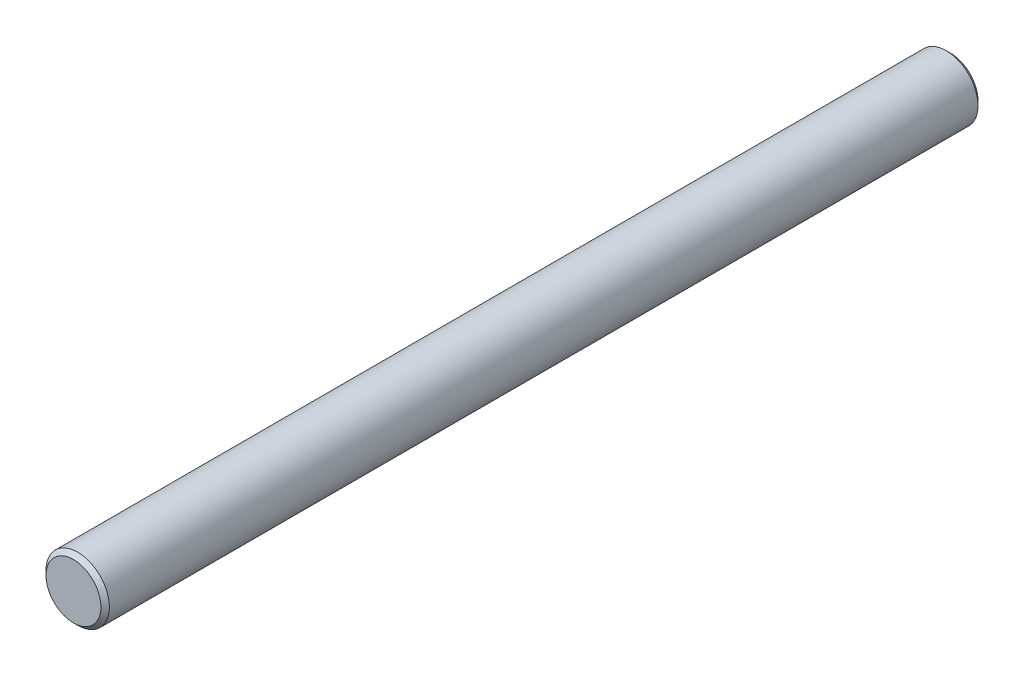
from build123d import *

# Parameters (mm, degrees)
ESQUISSE1_R            = 1.5
CYLINDRE_DE_BASE_DEPTH = 20.75
CHANFREIN1_SIZE        = 0.2


with BuildPart() as part:
    # Esquisse1 → Cylindre de base (new, symmetric)
    with BuildSketch(Plane.XY):
        with Locations(Location((0, 0, 0), (0, 0, 180))):
            Circle(ESQUISSE1_R)
    extrude(amount=CYLINDRE_DE_BASE_DEPTH, both=True)

    # Chanfrein1
    chanfrein1_edges = [part.edges().sort_by_distance(p)[0] for p in [
        (1.5, 0, -20.75),
        (1.5, 0, 20.75),
    ]]
    chamfer(chanfrein1_edges, length=CHANFREIN1_SIZE)


solid = part.part
